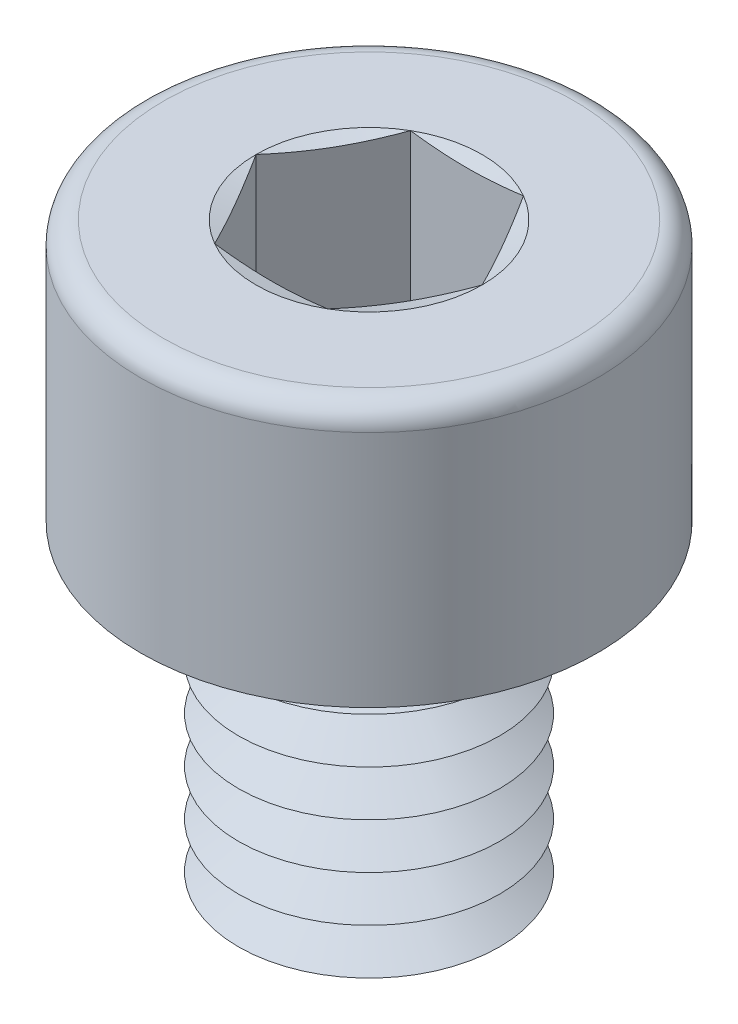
ISO-10303-21;
HEADER;
FILE_DESCRIPTION(('STEP AP214'),'2;1');
FILE_NAME('part.step','',(''),(''),'','','');
FILE_SCHEMA(('AUTOMOTIVE_DESIGN { 1 0 10303 214 1 1 1 1 }'));
ENDSEC;
DATA;
#1=APPLICATION_CONTEXT('core data for automotive mechanical design processes');
#2=APPLICATION_PROTOCOL_DEFINITION('international standard','automotive_design',2000,#1);
#3=PRODUCT_CONTEXT('',#1,'mechanical');
#4=PRODUCT('Part','Part','',(#3));
#5=PRODUCT_RELATED_PRODUCT_CATEGORY('part','',(#4));
#6=PRODUCT_DEFINITION_FORMATION('','',#4);
#7=PRODUCT_DEFINITION_CONTEXT('part definition',#1,'design');
#8=PRODUCT_DEFINITION('design','',#6,#7);
#9=PRODUCT_DEFINITION_SHAPE('','',#8);
#10=(LENGTH_UNIT() NAMED_UNIT(*) SI_UNIT(.MILLI.,.METRE.));
#11=(NAMED_UNIT(*) PLANE_ANGLE_UNIT() SI_UNIT($,.RADIAN.));
#12=(NAMED_UNIT(*) SI_UNIT($,.STERADIAN.) SOLID_ANGLE_UNIT());
#13=UNCERTAINTY_MEASURE_WITH_UNIT(LENGTH_MEASURE(1.E-05),#10,'distance_accuracy_value','');
#14=(GEOMETRIC_REPRESENTATION_CONTEXT(3) GLOBAL_UNCERTAINTY_ASSIGNED_CONTEXT((#13)) GLOBAL_UNIT_ASSIGNED_CONTEXT((#10,
#11,#12)) REPRESENTATION_CONTEXT('',''));
#15=CARTESIAN_POINT('',(0.,0.,0.));
#16=DIRECTION('',(0.,0.,1.));
#17=DIRECTION('',(1.,0.,0.));
#18=AXIS2_PLACEMENT_3D('',#15,#16,#17);
#19=CARTESIAN_POINT('',(0.,2.8,0.));
#20=DIRECTION('',(0.,1.,0.));
#21=DIRECTION('',(0.,0.,1.));
#22=AXIS2_PLACEMENT_3D('',#19,#20,#21);
#23=CONICAL_SURFACE('',#22,1.39378221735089,1.0471975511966);
#24=CARTESIAN_POINT('',(0.,3.15,0.));
#25=DIRECTION('',(0.,1.,0.));
#26=DIRECTION('',(0.,0.,1.));
#27=AXIS2_PLACEMENT_3D('',#24,#25,#26);
#28=CIRCLE('',#27,2.);
#29=CARTESIAN_POINT('',(0.,3.15,2.));
#30=VERTEX_POINT('',#29);
#31=EDGE_CURVE('E366',#30,#30,#28,.T.);
#32=ORIENTED_EDGE('',*,*,#31,.F.);
#33=EDGE_LOOP('',(#32));
#34=FACE_BOUND('',#33,.T.);
#35=CARTESIAN_POINT('',(0.,2.8,0.));
#36=DIRECTION('',(0.,1.,0.));
#37=DIRECTION('',(0.,0.,1.));
#38=AXIS2_PLACEMENT_3D('',#35,#36,#37);
#39=CIRCLE('',#38,1.39378221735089);
#40=CARTESIAN_POINT('',(0.,2.8,1.39378221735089));
#41=VERTEX_POINT('',#40);
#42=EDGE_CURVE('E370',#41,#41,#39,.T.);
#43=ORIENTED_EDGE('',*,*,#42,.T.);
#44=EDGE_LOOP('',(#43));
#45=FACE_BOUND('',#44,.T.);
#46=ADVANCED_FACE('F41',(#34,#45),#23,.T.);
#47=CARTESIAN_POINT('',(0.,2.45,0.));
#48=DIRECTION('',(0.,-1.,0.));
#49=DIRECTION('',(0.,0.,-1.));
#50=AXIS2_PLACEMENT_3D('',#47,#48,#49);
#51=CONICAL_SURFACE('',#50,2.,1.0471975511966);
#52=ORIENTED_EDGE('',*,*,#42,.F.);
#53=EDGE_LOOP('',(#52));
#54=FACE_BOUND('',#53,.T.);
#55=CARTESIAN_POINT('',(0.,2.45,0.));
#56=DIRECTION('',(0.,1.,0.));
#57=DIRECTION('',(0.,0.,1.));
#58=AXIS2_PLACEMENT_3D('',#55,#56,#57);
#59=CIRCLE('',#58,2.);
#60=CARTESIAN_POINT('',(0.,2.45,2.));
#61=VERTEX_POINT('',#60);
#62=EDGE_CURVE('E374',#61,#61,#59,.T.);
#63=ORIENTED_EDGE('',*,*,#62,.T.);
#64=EDGE_LOOP('',(#63));
#65=FACE_BOUND('',#64,.T.);
#66=ADVANCED_FACE('F250',(#54,#65),#51,.T.);
#67=CARTESIAN_POINT('',(0.,0.,0.));
#68=DIRECTION('',(0.,1.,0.));
#69=DIRECTION('',(0.,0.,1.));
#70=AXIS2_PLACEMENT_3D('',#67,#68,#69);
#71=PLANE('',#70);
#72=CARTESIAN_POINT('',(0.,0.,0.));
#73=DIRECTION('',(0.,1.,0.));
#74=DIRECTION('',(0.,0.,1.));
#75=AXIS2_PLACEMENT_3D('',#72,#73,#74);
#76=CIRCLE('',#75,1.39378221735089);
#77=CARTESIAN_POINT('',(0.,0.,1.39378221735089));
#78=VERTEX_POINT('',#77);
#79=EDGE_CURVE('E400',#78,#78,#76,.T.);
#80=ORIENTED_EDGE('',*,*,#79,.F.);
#81=EDGE_LOOP('',(#80));
#82=FACE_BOUND('',#81,.T.);
#83=ADVANCED_FACE('F247',(#82),#71,.F.);
#84=CARTESIAN_POINT('',(0.,0.,0.));
#85=DIRECTION('',(0.,1.,0.));
#86=DIRECTION('',(0.,0.,1.));
#87=AXIS2_PLACEMENT_3D('',#84,#85,#86);
#88=CONICAL_SURFACE('',#87,1.39378221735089,1.0471975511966);
#89=CARTESIAN_POINT('',(0.,0.35,0.));
#90=DIRECTION('',(0.,1.,0.));
#91=DIRECTION('',(0.,0.,1.));
#92=AXIS2_PLACEMENT_3D('',#89,#90,#91);
#93=CIRCLE('',#92,2.);
#94=CARTESIAN_POINT('',(0.,0.35,2.));
#95=VERTEX_POINT('',#94);
#96=EDGE_CURVE('E397',#95,#95,#93,.T.);
#97=ORIENTED_EDGE('',*,*,#96,.F.);
#98=EDGE_LOOP('',(#97));
#99=FACE_BOUND('',#98,.T.);
#100=ORIENTED_EDGE('',*,*,#79,.T.);
#101=EDGE_LOOP('',(#100));
#102=FACE_BOUND('',#101,.T.);
#103=ADVANCED_FACE('F249',(#99,#102),#88,.T.);
#104=CARTESIAN_POINT('',(0.,0.35,0.));
#105=DIRECTION('',(0.,-1.,0.));
#106=DIRECTION('',(0.,0.,-1.));
#107=AXIS2_PLACEMENT_3D('',#104,#105,#106);
#108=CONICAL_SURFACE('',#107,2.,1.0471975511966);
#109=CARTESIAN_POINT('',(0.,0.7,0.));
#110=DIRECTION('',(0.,1.,0.));
#111=DIRECTION('',(0.,0.,1.));
#112=AXIS2_PLACEMENT_3D('',#109,#110,#111);
#113=CIRCLE('',#112,1.39378221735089);
#114=CARTESIAN_POINT('',(0.,0.7,1.39378221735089));
#115=VERTEX_POINT('',#114);
#116=EDGE_CURVE('E393',#115,#115,#113,.T.);
#117=ORIENTED_EDGE('',*,*,#116,.F.);
#118=EDGE_LOOP('',(#117));
#119=FACE_BOUND('',#118,.T.);
#120=ORIENTED_EDGE('',*,*,#96,.T.);
#121=EDGE_LOOP('',(#120));
#122=FACE_BOUND('',#121,.T.);
#123=ADVANCED_FACE('F290',(#119,#122),#108,.T.);
#124=CARTESIAN_POINT('',(0.,0.7,0.));
#125=DIRECTION('',(0.,1.,0.));
#126=DIRECTION('',(0.,0.,1.));
#127=AXIS2_PLACEMENT_3D('',#124,#125,#126);
#128=CONICAL_SURFACE('',#127,1.39378221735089,1.0471975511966);
#129=CARTESIAN_POINT('',(0.,1.05,0.));
#130=DIRECTION('',(0.,1.,0.));
#131=DIRECTION('',(0.,0.,1.));
#132=AXIS2_PLACEMENT_3D('',#129,#130,#131);
#133=CIRCLE('',#132,2.);
#134=CARTESIAN_POINT('',(0.,1.05,2.));
#135=VERTEX_POINT('',#134);
#136=EDGE_CURVE('E389',#135,#135,#133,.T.);
#137=ORIENTED_EDGE('',*,*,#136,.F.);
#138=EDGE_LOOP('',(#137));
#139=FACE_BOUND('',#138,.T.);
#140=ORIENTED_EDGE('',*,*,#116,.T.);
#141=EDGE_LOOP('',(#140));
#142=FACE_BOUND('',#141,.T.);
#143=ADVANCED_FACE('F285',(#139,#142),#128,.T.);
#144=CARTESIAN_POINT('',(0.,1.05,0.));
#145=DIRECTION('',(0.,-1.,0.));
#146=DIRECTION('',(0.,0.,-1.));
#147=AXIS2_PLACEMENT_3D('',#144,#145,#146);
#148=CONICAL_SURFACE('',#147,2.,1.0471975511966);
#149=CARTESIAN_POINT('',(0.,1.4,0.));
#150=DIRECTION('',(0.,1.,0.));
#151=DIRECTION('',(0.,0.,1.));
#152=AXIS2_PLACEMENT_3D('',#149,#150,#151);
#153=CIRCLE('',#152,1.39378221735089);
#154=CARTESIAN_POINT('',(0.,1.4,1.39378221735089));
#155=VERTEX_POINT('',#154);
#156=EDGE_CURVE('E385',#155,#155,#153,.T.);
#157=ORIENTED_EDGE('',*,*,#156,.F.);
#158=EDGE_LOOP('',(#157));
#159=FACE_BOUND('',#158,.T.);
#160=ORIENTED_EDGE('',*,*,#136,.T.);
#161=EDGE_LOOP('',(#160));
#162=FACE_BOUND('',#161,.T.);
#163=ADVANCED_FACE('F282',(#159,#162),#148,.T.);
#164=CARTESIAN_POINT('',(0.,1.4,0.));
#165=DIRECTION('',(0.,1.,0.));
#166=DIRECTION('',(0.,0.,1.));
#167=AXIS2_PLACEMENT_3D('',#164,#165,#166);
#168=CONICAL_SURFACE('',#167,1.39378221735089,1.0471975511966);
#169=CARTESIAN_POINT('',(0.,1.75,0.));
#170=DIRECTION('',(0.,1.,0.));
#171=DIRECTION('',(0.,0.,1.));
#172=AXIS2_PLACEMENT_3D('',#169,#170,#171);
#173=CIRCLE('',#172,2.);
#174=CARTESIAN_POINT('',(0.,1.75,2.));
#175=VERTEX_POINT('',#174);
#176=EDGE_CURVE('E381',#175,#175,#173,.T.);
#177=ORIENTED_EDGE('',*,*,#176,.F.);
#178=EDGE_LOOP('',(#177));
#179=FACE_BOUND('',#178,.T.);
#180=ORIENTED_EDGE('',*,*,#156,.T.);
#181=EDGE_LOOP('',(#180));
#182=FACE_BOUND('',#181,.T.);
#183=ADVANCED_FACE('F276',(#179,#182),#168,.T.);
#184=CARTESIAN_POINT('',(0.,1.75,0.));
#185=DIRECTION('',(0.,-1.,0.));
#186=DIRECTION('',(0.,0.,-1.));
#187=AXIS2_PLACEMENT_3D('',#184,#185,#186);
#188=CONICAL_SURFACE('',#187,2.,1.0471975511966);
#189=CARTESIAN_POINT('',(0.,2.1,0.));
#190=DIRECTION('',(0.,1.,0.));
#191=DIRECTION('',(0.,0.,1.));
#192=AXIS2_PLACEMENT_3D('',#189,#190,#191);
#193=CIRCLE('',#192,1.39378221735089);
#194=CARTESIAN_POINT('',(0.,2.1,1.39378221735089));
#195=VERTEX_POINT('',#194);
#196=EDGE_CURVE('E377',#195,#195,#193,.T.);
#197=ORIENTED_EDGE('',*,*,#196,.F.);
#198=EDGE_LOOP('',(#197));
#199=FACE_BOUND('',#198,.T.);
#200=ORIENTED_EDGE('',*,*,#176,.T.);
#201=EDGE_LOOP('',(#200));
#202=FACE_BOUND('',#201,.T.);
#203=ADVANCED_FACE('F272',(#199,#202),#188,.T.);
#204=CARTESIAN_POINT('',(0.,2.1,0.));
#205=DIRECTION('',(0.,1.,0.));
#206=DIRECTION('',(0.,0.,1.));
#207=AXIS2_PLACEMENT_3D('',#204,#205,#206);
#208=CONICAL_SURFACE('',#207,1.39378221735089,1.0471975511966);
#209=ORIENTED_EDGE('',*,*,#62,.F.);
#210=EDGE_LOOP('',(#209));
#211=FACE_BOUND('',#210,.T.);
#212=ORIENTED_EDGE('',*,*,#196,.T.);
#213=EDGE_LOOP('',(#212));
#214=FACE_BOUND('',#213,.T.);
#215=ADVANCED_FACE('F275',(#211,#214),#208,.T.);
#216=CARTESIAN_POINT('',(0.,3.5,0.));
#217=DIRECTION('',(0.,1.,0.));
#218=DIRECTION('',(0.,0.,1.));
#219=AXIS2_PLACEMENT_3D('',#216,#217,#218);
#220=CONICAL_SURFACE('',#219,1.39378221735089,1.0471975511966);
#221=CARTESIAN_POINT('',(0.,3.85,0.));
#222=DIRECTION('',(0.,1.,0.));
#223=DIRECTION('',(0.,0.,1.));
#224=AXIS2_PLACEMENT_3D('',#221,#222,#223);
#225=CIRCLE('',#224,2.);
#226=CARTESIAN_POINT('',(0.,3.85,2.));
#227=VERTEX_POINT('',#226);
#228=EDGE_CURVE('E352',#227,#227,#225,.T.);
#229=ORIENTED_EDGE('',*,*,#228,.F.);
#230=EDGE_LOOP('',(#229));
#231=FACE_BOUND('',#230,.T.);
#232=CARTESIAN_POINT('',(0.,3.5,0.));
#233=DIRECTION('',(0.,1.,0.));
#234=DIRECTION('',(0.,0.,1.));
#235=AXIS2_PLACEMENT_3D('',#232,#233,#234);
#236=CIRCLE('',#235,1.39378221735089);
#237=CARTESIAN_POINT('',(0.,3.5,1.39378221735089));
#238=VERTEX_POINT('',#237);
#239=EDGE_CURVE('E362',#238,#238,#236,.T.);
#240=ORIENTED_EDGE('',*,*,#239,.T.);
#241=EDGE_LOOP('',(#240));
#242=FACE_BOUND('',#241,.T.);
#243=ADVANCED_FACE('F280',(#231,#242),#220,.T.);
#244=CARTESIAN_POINT('',(0.,3.15,0.));
#245=DIRECTION('',(0.,-1.,0.));
#246=DIRECTION('',(0.,0.,-1.));
#247=AXIS2_PLACEMENT_3D('',#244,#245,#246);
#248=CONICAL_SURFACE('',#247,2.,1.0471975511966);
#249=ORIENTED_EDGE('',*,*,#239,.F.);
#250=EDGE_LOOP('',(#249));
#251=FACE_BOUND('',#250,.T.);
#252=ORIENTED_EDGE('',*,*,#31,.T.);
#253=EDGE_LOOP('',(#252));
#254=FACE_BOUND('',#253,.T.);
#255=ADVANCED_FACE('F633',(#251,#254),#248,.T.);
#256=CARTESIAN_POINT('',(0.,4.2,0.));
#257=DIRECTION('',(0.,1.,0.));
#258=DIRECTION('',(0.,0.,1.));
#259=AXIS2_PLACEMENT_3D('',#256,#257,#258);
#260=CONICAL_SURFACE('',#259,1.39378221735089,1.0471975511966);
#261=CARTESIAN_POINT('',(0.,4.55,0.));
#262=DIRECTION('',(0.,1.,0.));
#263=DIRECTION('',(0.,0.,1.));
#264=AXIS2_PLACEMENT_3D('',#261,#262,#263);
#265=CIRCLE('',#264,2.);
#266=CARTESIAN_POINT('',(0.,4.55,2.));
#267=VERTEX_POINT('',#266);
#268=EDGE_CURVE('E358',#267,#267,#265,.T.);
#269=ORIENTED_EDGE('',*,*,#268,.F.);
#270=EDGE_LOOP('',(#269));
#271=FACE_BOUND('',#270,.T.);
#272=CARTESIAN_POINT('',(0.,4.2,0.));
#273=DIRECTION('',(0.,1.,0.));
#274=DIRECTION('',(0.,0.,1.));
#275=AXIS2_PLACEMENT_3D('',#272,#273,#274);
#276=CIRCLE('',#275,1.39378221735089);
#277=CARTESIAN_POINT('',(0.,4.2,1.39378221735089));
#278=VERTEX_POINT('',#277);
#279=EDGE_CURVE('E347',#278,#278,#276,.T.);
#280=ORIENTED_EDGE('',*,*,#279,.T.);
#281=EDGE_LOOP('',(#280));
#282=FACE_BOUND('',#281,.T.);
#283=ADVANCED_FACE('F642',(#271,#282),#260,.T.);
#284=CARTESIAN_POINT('',(0.,3.85,0.));
#285=DIRECTION('',(0.,-1.,0.));
#286=DIRECTION('',(0.,0.,-1.));
#287=AXIS2_PLACEMENT_3D('',#284,#285,#286);
#288=CONICAL_SURFACE('',#287,2.,1.0471975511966);
#289=ORIENTED_EDGE('',*,*,#279,.F.);
#290=EDGE_LOOP('',(#289));
#291=FACE_BOUND('',#290,.T.);
#292=ORIENTED_EDGE('',*,*,#228,.T.);
#293=EDGE_LOOP('',(#292));
#294=FACE_BOUND('',#293,.T.);
#295=ADVANCED_FACE('F194',(#291,#294),#288,.T.);
#296=CARTESIAN_POINT('',(0.,9.,0.));
#297=DIRECTION('',(0.,1.,0.));
#298=DIRECTION('',(0.,0.,1.));
#299=AXIS2_PLACEMENT_3D('',#296,#297,#298);
#300=PLANE('',#299);
#301=CARTESIAN_POINT('',(0.,9.,0.));
#302=DIRECTION('',(0.,1.,0.));
#303=DIRECTION('',(0.,0.,1.));
#304=AXIS2_PLACEMENT_3D('',#301,#302,#303);
#305=CIRCLE('',#304,1.73205080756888);
#306=CARTESIAN_POINT('',(0.86602540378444,9.,1.5));
#307=VERTEX_POINT('',#306);
#308=CARTESIAN_POINT('',(1.73205080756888,9.,0.));
#309=VERTEX_POINT('',#308);
#310=EDGE_CURVE('E121',#307,#309,#305,.T.);
#311=ORIENTED_EDGE('',*,*,#310,.F.);
#312=CARTESIAN_POINT('',(0.,9.,0.));
#313=DIRECTION('',(0.,1.,0.));
#314=DIRECTION('',(0.,0.,1.));
#315=AXIS2_PLACEMENT_3D('',#312,#313,#314);
#316=CIRCLE('',#315,1.73205080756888);
#317=CARTESIAN_POINT('',(-0.866025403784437,9.,1.5));
#318=VERTEX_POINT('',#317);
#319=EDGE_CURVE('E45',#318,#307,#316,.T.);
#320=ORIENTED_EDGE('',*,*,#319,.F.);
#321=CARTESIAN_POINT('',(-1.73205080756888,9.,0.));
#322=VERTEX_POINT('',#321);
#323=EDGE_CURVE('E138',#322,#318,#316,.T.);
#324=ORIENTED_EDGE('',*,*,#323,.F.);
#325=CARTESIAN_POINT('',(-0.866025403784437,9.,-1.5));
#326=VERTEX_POINT('',#325);
#327=EDGE_CURVE('E764',#326,#322,#316,.T.);
#328=ORIENTED_EDGE('',*,*,#327,.F.);
#329=CARTESIAN_POINT('',(0.866025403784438,9.,-1.5));
#330=VERTEX_POINT('',#329);
#331=EDGE_CURVE('E51',#330,#326,#316,.T.);
#332=ORIENTED_EDGE('',*,*,#331,.F.);
#333=EDGE_CURVE('E11',#309,#330,#316,.T.);
#334=ORIENTED_EDGE('',*,*,#333,.F.);
#335=EDGE_LOOP('',(#311,#320,#324,#328,#332,#334));
#336=FACE_BOUND('',#335,.T.);
#337=CARTESIAN_POINT('',(0.,9.,0.));
#338=DIRECTION('',(0.,1.,0.));
#339=DIRECTION('',(0.,0.,1.));
#340=AXIS2_PLACEMENT_3D('',#337,#338,#339);
#341=CIRCLE('',#340,3.15);
#342=CARTESIAN_POINT('',(0.,9.,3.15));
#343=VERTEX_POINT('',#342);
#344=EDGE_CURVE('E444',#343,#343,#341,.T.);
#345=ORIENTED_EDGE('',*,*,#344,.T.);
#346=EDGE_LOOP('',(#345));
#347=FACE_BOUND('',#346,.T.);
#348=ADVANCED_FACE('F140',(#336,#347),#300,.T.);
#349=CARTESIAN_POINT('',(0.,8.65,0.));
#350=DIRECTION('',(0.,1.,0.));
#351=DIRECTION('',(0.,0.,1.));
#352=AXIS2_PLACEMENT_3D('',#349,#350,#351);
#353=TOROIDAL_SURFACE('',#352,3.15,0.35);
#354=CARTESIAN_POINT('',(0.,8.65,0.));
#355=DIRECTION('',(0.,1.,0.));
#356=DIRECTION('',(0.,0.,1.));
#357=AXIS2_PLACEMENT_3D('',#354,#355,#356);
#358=CIRCLE('',#357,3.5);
#359=CARTESIAN_POINT('',(0.,8.65,3.5));
#360=VERTEX_POINT('',#359);
#361=EDGE_CURVE('E448',#360,#360,#358,.F.);
#362=ORIENTED_EDGE('',*,*,#361,.F.);
#363=EDGE_LOOP('',(#362));
#364=FACE_BOUND('',#363,.T.);
#365=ORIENTED_EDGE('',*,*,#344,.F.);
#366=EDGE_LOOP('',(#365));
#367=FACE_BOUND('',#366,.T.);
#368=ADVANCED_FACE('F43',(#364,#367),#353,.T.);
#369=CARTESIAN_POINT('',(0.,9.,0.));
#370=DIRECTION('',(0.,-1.,0.));
#371=DIRECTION('',(0.,0.,-1.));
#372=AXIS2_PLACEMENT_3D('',#369,#370,#371);
#373=CYLINDRICAL_SURFACE('',#372,3.5);
#374=ORIENTED_EDGE('',*,*,#361,.T.);
#375=EDGE_LOOP('',(#374));
#376=FACE_BOUND('',#375,.T.);
#377=CARTESIAN_POINT('',(0.,5.,0.));
#378=DIRECTION('',(0.,1.,0.));
#379=DIRECTION('',(0.,0.,1.));
#380=AXIS2_PLACEMENT_3D('',#377,#378,#379);
#381=CIRCLE('',#380,3.5);
#382=CARTESIAN_POINT('',(0.,5.,3.5));
#383=VERTEX_POINT('',#382);
#384=EDGE_CURVE('E431',#383,#383,#381,.T.);
#385=ORIENTED_EDGE('',*,*,#384,.T.);
#386=EDGE_LOOP('',(#385));
#387=FACE_BOUND('',#386,.T.);
#388=ADVANCED_FACE('F242',(#376,#387),#373,.T.);
#389=CARTESIAN_POINT('',(0.,5.,0.));
#390=DIRECTION('',(0.,1.,0.));
#391=DIRECTION('',(0.,0.,1.));
#392=AXIS2_PLACEMENT_3D('',#389,#390,#391);
#393=PLANE('',#392);
#394=ORIENTED_EDGE('',*,*,#384,.F.);
#395=EDGE_LOOP('',(#394));
#396=FACE_BOUND('',#395,.T.);
#397=CARTESIAN_POINT('',(0.,5.,0.));
#398=DIRECTION('',(0.,1.,0.));
#399=DIRECTION('',(0.,0.,1.));
#400=AXIS2_PLACEMENT_3D('',#397,#398,#399);
#401=CIRCLE('',#400,2.);
#402=CARTESIAN_POINT('',(0.,5.,2.));
#403=VERTEX_POINT('',#402);
#404=EDGE_CURVE('E440',#403,#403,#401,.T.);
#405=ORIENTED_EDGE('',*,*,#404,.T.);
#406=EDGE_LOOP('',(#405));
#407=FACE_BOUND('',#406,.T.);
#408=ADVANCED_FACE('F238',(#396,#407),#393,.F.);
#409=CARTESIAN_POINT('',(0.,5.,0.));
#410=DIRECTION('',(0.,-1.,0.));
#411=DIRECTION('',(0.,0.,-1.));
#412=AXIS2_PLACEMENT_3D('',#409,#410,#411);
#413=CYLINDRICAL_SURFACE('',#412,2.);
#414=ORIENTED_EDGE('',*,*,#268,.T.);
#415=EDGE_LOOP('',(#414));
#416=FACE_BOUND('',#415,.T.);
#417=ORIENTED_EDGE('',*,*,#404,.F.);
#418=EDGE_LOOP('',(#417));
#419=FACE_BOUND('',#418,.T.);
#420=ADVANCED_FACE('F241',(#416,#419),#413,.T.);
#421=CARTESIAN_POINT('',(0.,9.,0.));
#422=DIRECTION('',(0.,1.,0.));
#423=DIRECTION('',(0.,0.,1.));
#424=AXIS2_PLACEMENT_3D('',#421,#422,#423);
#425=CONICAL_SURFACE('',#424,1.73205080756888,1.30899693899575);
#426=ORIENTED_EDGE('',*,*,#319,.T.);
#427=CARTESIAN_POINT('',(-2.26080568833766,9.26288767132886,1.5));
#428=CARTESIAN_POINT('',(-2.19307335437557,9.24776718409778,1.5));
#429=CARTESIAN_POINT('',(-2.12529797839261,9.23283936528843,1.5));
#430=CARTESIAN_POINT('',(-1.989639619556,9.2034664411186,1.5));
#431=CARTESIAN_POINT('',(-1.92175663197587,9.1890213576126,1.5));
#432=CARTESIAN_POINT('',(-1.71778516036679,9.1465295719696,1.5));
#433=CARTESIAN_POINT('',(-1.58151166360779,9.11935744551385,1.5));
#434=CARTESIAN_POINT('',(-1.30947840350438,9.06878855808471,1.5));
#435=CARTESIAN_POINT('',(-1.17372447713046,9.04536102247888,1.5));
#436=CARTESIAN_POINT('',(-0.901404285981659,9.00385032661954,1.5));
#437=CARTESIAN_POINT('',(-0.764838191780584,8.98576608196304,1.5));
#438=CARTESIAN_POINT('',(-0.4892931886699,8.95729203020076,1.5));
#439=CARTESIAN_POINT('',(-0.350304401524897,8.94699084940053,1.5));
#440=CARTESIAN_POINT('',(-0.14157144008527,8.93918165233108,1.5));
#441=CARTESIAN_POINT('',(-0.0719628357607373,8.93785196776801,1.5));
#442=CARTESIAN_POINT('',(0.067255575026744,8.93779336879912,1.5));
#443=CARTESIAN_POINT('',(0.136865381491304,8.93906445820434,1.5));
#444=CARTESIAN_POINT('',(0.34611430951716,8.94672257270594,1.5));
#445=CARTESIAN_POINT('',(0.485619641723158,8.95697478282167,1.5));
#446=CARTESIAN_POINT('',(0.763829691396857,8.98560011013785,1.5));
#447=CARTESIAN_POINT('',(0.902533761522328,9.00397905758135,1.5));
#448=CARTESIAN_POINT('',(1.18270277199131,9.04677522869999,1.5));
#449=CARTESIAN_POINT('',(1.32414472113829,9.07133816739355,1.5));
#450=CARTESIAN_POINT('',(1.60634089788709,9.12417713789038,1.5));
#451=CARTESIAN_POINT('',(1.74709501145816,9.15245376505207,1.5));
#452=CARTESIAN_POINT('',(2.0281352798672,9.21141289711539,1.5));
#453=CARTESIAN_POINT('',(2.16842128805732,9.24209609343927,1.5));
#454=CARTESIAN_POINT('',(2.44863558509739,9.30505759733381,1.5));
#455=CARTESIAN_POINT('',(2.5885638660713,9.3373359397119,1.5));
#456=CARTESIAN_POINT('',(2.86645602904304,9.40258693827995,1.5));
#457=CARTESIAN_POINT('',(3.00442304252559,9.43554631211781,1.5));
#458=CARTESIAN_POINT('',(3.28017563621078,9.50222717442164,1.5));
#459=CARTESIAN_POINT('',(3.41796121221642,9.53594868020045,1.5));
#460=CARTESIAN_POINT('',(3.69320305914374,9.60389962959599,1.5));
#461=CARTESIAN_POINT('',(3.83065952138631,9.63812829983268,1.5));
#462=CARTESIAN_POINT('',(4.10546119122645,9.70700872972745,1.5));
#463=CARTESIAN_POINT('',(4.24280640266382,9.7416604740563,1.5));
#464=CARTESIAN_POINT('',(4.38011382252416,9.77645965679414,1.5));
#465=B_SPLINE_CURVE_WITH_KNOTS('',3,(#427,#428,#429,#430,#431,#432,#433,#434,#435,#436,#437,
#438,#439,#440,#441,#442,#443,#444,#445,#446,#447,#448,#449,#450,#451,#452,#453,#454,#455,#456,
#457,#458,#459,#460,#461,#462,#463,#464),.UNSPECIFIED.,.F.,.F.,(4,2,2,2,2,2,2,2,2,2,2,2,2,2,2,2,
2,2,4),(0.,0.208198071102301,0.416405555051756,0.833243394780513,1.2464565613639,
1.65958581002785,2.07735129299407,2.28617008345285,2.49498917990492,2.91428402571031,
3.33388016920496,3.76448033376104,4.19514961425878,4.62594308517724,5.05674596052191,
5.48229088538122,5.90784548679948,6.33280701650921,6.75775319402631),.UNSPECIFIED.);
#466=EDGE_CURVE('E127',#318,#307,#465,.T.);
#467=ORIENTED_EDGE('',*,*,#466,.F.);
#468=EDGE_LOOP('',(#426,#467));
#469=FACE_BOUND('',#468,.T.);
#470=ADVANCED_FACE('F132',(#469),#425,.F.);
#471=ORIENTED_EDGE('',*,*,#323,.T.);
#472=CARTESIAN_POINT('',(-1.73216627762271,9.00003094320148,-0.000200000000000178));
#473=CARTESIAN_POINT('',(-1.69619286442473,8.99038632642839,0.0621077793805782));
#474=CARTESIAN_POINT('',(-1.66015421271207,8.98163049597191,0.124528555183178));
#475=CARTESIAN_POINT('',(-1.58794959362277,8.96624719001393,0.249590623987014));
#476=CARTESIAN_POINT('',(-1.55178358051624,8.9596205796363,0.312231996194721));
#477=CARTESIAN_POINT('',(-1.47954358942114,8.94888268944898,0.437355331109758));
#478=CARTESIAN_POINT('',(-1.44347010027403,8.94475860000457,0.499836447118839));
#479=CARTESIAN_POINT('',(-1.37127710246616,8.93922860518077,0.624878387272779));
#480=CARTESIAN_POINT('',(-1.33515760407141,8.93782217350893,0.68743919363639));
#481=CARTESIAN_POINT('',(-1.26291860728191,8.93782217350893,0.81256080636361));
#482=CARTESIAN_POINT('',(-1.22679910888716,8.93922860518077,0.875121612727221));
#483=CARTESIAN_POINT('',(-1.15460611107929,8.94475860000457,1.00016355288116));
#484=CARTESIAN_POINT('',(-1.11853262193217,8.94888268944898,1.06264466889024));
#485=CARTESIAN_POINT('',(-1.04629263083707,8.9596205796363,1.18776800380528));
#486=CARTESIAN_POINT('',(-1.01012661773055,8.96624719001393,1.25040937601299));
#487=CARTESIAN_POINT('',(-0.93792199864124,8.98163049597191,1.37547144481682));
#488=CARTESIAN_POINT('',(-0.901883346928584,8.99038632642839,1.43789222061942));
#489=CARTESIAN_POINT('',(-0.8659099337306,9.00003094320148,1.5002));
#490=B_SPLINE_CURVE_WITH_KNOTS('',3,(#472,#473,#474,#475,#476,#477,#478,#479,#480,#481,#482,
#483,#484,#485,#486,#487,#488,#489),.UNSPECIFIED.,.F.,.F.,(4,2,2,2,2,2,2,2,4),(0.,
0.217782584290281,0.435653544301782,0.652399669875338,0.869103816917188,1.08580796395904,
1.30255408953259,1.52042504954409,1.73820763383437),.UNSPECIFIED.);
#491=EDGE_CURVE('E163',#322,#318,#490,.T.);
#492=ORIENTED_EDGE('',*,*,#491,.F.);
#493=EDGE_LOOP('',(#471,#492));
#494=FACE_BOUND('',#493,.T.);
#495=ADVANCED_FACE('F257',(#494),#425,.F.);
#496=ORIENTED_EDGE('',*,*,#327,.T.);
#497=CARTESIAN_POINT('',(-0.865909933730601,9.00003094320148,-1.5002));
#498=CARTESIAN_POINT('',(-0.901883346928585,8.99038632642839,-1.43789222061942));
#499=CARTESIAN_POINT('',(-0.937921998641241,8.98163049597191,-1.37547144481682));
#500=CARTESIAN_POINT('',(-1.01012661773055,8.96624719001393,-1.25040937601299));
#501=CARTESIAN_POINT('',(-1.04629263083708,8.9596205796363,-1.18776800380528));
#502=CARTESIAN_POINT('',(-1.11853262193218,8.94888268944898,-1.06264466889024));
#503=CARTESIAN_POINT('',(-1.15460611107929,8.94475860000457,-1.00016355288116));
#504=CARTESIAN_POINT('',(-1.22679910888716,8.93922860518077,-0.875121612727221));
#505=CARTESIAN_POINT('',(-1.26291860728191,8.93782217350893,-0.81256080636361));
#506=CARTESIAN_POINT('',(-1.33515760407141,8.93782217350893,-0.68743919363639));
#507=CARTESIAN_POINT('',(-1.37127710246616,8.93922860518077,-0.624878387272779));
#508=CARTESIAN_POINT('',(-1.44347010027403,8.94475860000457,-0.499836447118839));
#509=CARTESIAN_POINT('',(-1.47954358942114,8.94888268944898,-0.437355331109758));
#510=CARTESIAN_POINT('',(-1.55178358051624,8.9596205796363,-0.312231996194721));
#511=CARTESIAN_POINT('',(-1.58794959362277,8.96624719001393,-0.249590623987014));
#512=CARTESIAN_POINT('',(-1.66015421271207,8.98163049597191,-0.124528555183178));
#513=CARTESIAN_POINT('',(-1.69619286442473,8.99038632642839,-0.0621077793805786));
#514=CARTESIAN_POINT('',(-1.73216627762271,9.00003094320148,0.000199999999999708));
#515=B_SPLINE_CURVE_WITH_KNOTS('',3,(#497,#498,#499,#500,#501,#502,#503,#504,#505,#506,#507,
#508,#509,#510,#511,#512,#513,#514),.UNSPECIFIED.,.F.,.F.,(4,2,2,2,2,2,2,2,4),(0.,
0.217782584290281,0.435653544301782,0.652399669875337,0.869103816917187,1.08580796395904,
1.30255408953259,1.52042504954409,1.73820763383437),.UNSPECIFIED.);
#516=EDGE_CURVE('E63',#326,#322,#515,.T.);
#517=ORIENTED_EDGE('',*,*,#516,.F.);
#518=EDGE_LOOP('',(#496,#517));
#519=FACE_BOUND('',#518,.T.);
#520=ADVANCED_FACE('F192',(#519),#425,.F.);
#521=ORIENTED_EDGE('',*,*,#331,.T.);
#522=CARTESIAN_POINT('',(-2.26080568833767,9.26288767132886,-1.5));
#523=CARTESIAN_POINT('',(-2.19307335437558,9.24776718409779,-1.5));
#524=CARTESIAN_POINT('',(-2.12529797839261,9.23283936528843,-1.5));
#525=CARTESIAN_POINT('',(-1.989639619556,9.2034664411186,-1.5));
#526=CARTESIAN_POINT('',(-1.92175663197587,9.1890213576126,-1.5));
#527=CARTESIAN_POINT('',(-1.71778516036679,9.1465295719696,-1.5));
#528=CARTESIAN_POINT('',(-1.58151166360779,9.11935744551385,-1.5));
#529=CARTESIAN_POINT('',(-1.30947840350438,9.06878855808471,-1.5));
#530=CARTESIAN_POINT('',(-1.17372447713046,9.04536102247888,-1.5));
#531=CARTESIAN_POINT('',(-0.901404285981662,9.00385032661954,-1.5));
#532=CARTESIAN_POINT('',(-0.764838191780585,8.98576608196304,-1.5));
#533=CARTESIAN_POINT('',(-0.489293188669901,8.95729203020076,-1.5));
#534=CARTESIAN_POINT('',(-0.350304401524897,8.94699084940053,-1.5));
#535=CARTESIAN_POINT('',(-0.14157144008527,8.93918165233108,-1.5));
#536=CARTESIAN_POINT('',(-0.0719628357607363,8.93785196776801,-1.5));
#537=CARTESIAN_POINT('',(0.0672555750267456,8.93779336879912,-1.5));
#538=CARTESIAN_POINT('',(0.136865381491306,8.93906445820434,-1.5));
#539=CARTESIAN_POINT('',(0.346114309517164,8.94672257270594,-1.5));
#540=CARTESIAN_POINT('',(0.485619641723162,8.95697478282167,-1.5));
#541=CARTESIAN_POINT('',(0.763829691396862,8.98560011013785,-1.5));
#542=CARTESIAN_POINT('',(0.902533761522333,9.00397905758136,-1.5));
#543=CARTESIAN_POINT('',(1.18270277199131,9.04677522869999,-1.5));
#544=CARTESIAN_POINT('',(1.32414472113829,9.07133816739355,-1.5));
#545=CARTESIAN_POINT('',(1.60634089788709,9.12417713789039,-1.5));
#546=CARTESIAN_POINT('',(1.74709501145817,9.15245376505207,-1.5));
#547=CARTESIAN_POINT('',(2.02813527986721,9.21141289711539,-1.5));
#548=CARTESIAN_POINT('',(2.16842128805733,9.24209609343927,-1.5));
#549=CARTESIAN_POINT('',(2.4486355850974,9.30505759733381,-1.5));
#550=CARTESIAN_POINT('',(2.5885638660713,9.3373359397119,-1.5));
#551=CARTESIAN_POINT('',(2.86645602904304,9.40258693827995,-1.5));
#552=CARTESIAN_POINT('',(3.0044230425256,9.43554631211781,-1.5));
#553=CARTESIAN_POINT('',(3.28017563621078,9.50222717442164,-1.5));
#554=CARTESIAN_POINT('',(3.41796121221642,9.53594868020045,-1.5));
#555=CARTESIAN_POINT('',(3.69320305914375,9.60389962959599,-1.5));
#556=CARTESIAN_POINT('',(3.83065952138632,9.63812829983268,-1.5));
#557=CARTESIAN_POINT('',(4.10546119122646,9.70700872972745,-1.5));
#558=CARTESIAN_POINT('',(4.24280640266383,9.7416604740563,-1.5));
#559=CARTESIAN_POINT('',(4.38011382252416,9.77645965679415,-1.5));
#560=B_SPLINE_CURVE_WITH_KNOTS('',3,(#522,#523,#524,#525,#526,#527,#528,#529,#530,#531,#532,
#533,#534,#535,#536,#537,#538,#539,#540,#541,#542,#543,#544,#545,#546,#547,#548,#549,#550,#551,
#552,#553,#554,#555,#556,#557,#558,#559),.UNSPECIFIED.,.F.,.F.,(4,2,2,2,2,2,2,2,2,2,2,2,2,2,2,2,
2,2,4),(0.,0.208198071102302,0.416405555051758,0.833243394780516,1.2464565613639,
1.65958581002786,2.07735129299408,2.28617008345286,2.49498917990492,2.91428402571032,
3.33388016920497,3.76448033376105,4.19514961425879,4.62594308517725,5.05674596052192,
5.48229088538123,5.90784548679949,6.33280701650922,6.75775319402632),.UNSPECIFIED.);
#561=EDGE_CURVE('E213',#330,#326,#560,.F.);
#562=ORIENTED_EDGE('',*,*,#561,.F.);
#563=EDGE_LOOP('',(#521,#562));
#564=FACE_BOUND('',#563,.T.);
#565=ADVANCED_FACE('F187',(#564),#425,.F.);
#566=ORIENTED_EDGE('',*,*,#333,.T.);
#567=CARTESIAN_POINT('',(1.73216627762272,9.00003094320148,0.00020000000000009));
#568=CARTESIAN_POINT('',(1.69619286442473,8.99038632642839,-0.0621077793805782));
#569=CARTESIAN_POINT('',(1.66015421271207,8.98163049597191,-0.124528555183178));
#570=CARTESIAN_POINT('',(1.58794959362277,8.96624719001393,-0.249590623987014));
#571=CARTESIAN_POINT('',(1.55178358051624,8.9596205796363,-0.312231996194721));
#572=CARTESIAN_POINT('',(1.47954358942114,8.94888268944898,-0.437355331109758));
#573=CARTESIAN_POINT('',(1.44347010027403,8.94475860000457,-0.499836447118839));
#574=CARTESIAN_POINT('',(1.37127710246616,8.93922860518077,-0.624878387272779));
#575=CARTESIAN_POINT('',(1.33515760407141,8.93782217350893,-0.68743919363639));
#576=CARTESIAN_POINT('',(1.26291860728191,8.93782217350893,-0.81256080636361));
#577=CARTESIAN_POINT('',(1.22679910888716,8.93922860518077,-0.875121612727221));
#578=CARTESIAN_POINT('',(1.15460611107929,8.94475860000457,-1.00016355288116));
#579=CARTESIAN_POINT('',(1.11853262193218,8.94888268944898,-1.06264466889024));
#580=CARTESIAN_POINT('',(1.04629263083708,8.9596205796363,-1.18776800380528));
#581=CARTESIAN_POINT('',(1.01012661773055,8.96624719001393,-1.25040937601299));
#582=CARTESIAN_POINT('',(0.937921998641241,8.98163049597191,-1.37547144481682));
#583=CARTESIAN_POINT('',(0.901883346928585,8.99038632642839,-1.43789222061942));
#584=CARTESIAN_POINT('',(0.8659099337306,9.00003094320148,-1.5002));
#585=B_SPLINE_CURVE_WITH_KNOTS('',3,(#567,#568,#569,#570,#571,#572,#573,#574,#575,#576,#577,
#578,#579,#580,#581,#582,#583,#584),.UNSPECIFIED.,.F.,.F.,(4,2,2,2,2,2,2,2,4),(0.,
0.217782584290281,0.435653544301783,0.652399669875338,0.869103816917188,1.08580796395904,
1.30255408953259,1.52042504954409,1.73820763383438),.UNSPECIFIED.);
#586=EDGE_CURVE('E56',#309,#330,#585,.T.);
#587=ORIENTED_EDGE('',*,*,#586,.F.);
#588=EDGE_LOOP('',(#566,#587));
#589=FACE_BOUND('',#588,.T.);
#590=ADVANCED_FACE('F191',(#589),#425,.F.);
#591=ORIENTED_EDGE('',*,*,#310,.T.);
#592=CARTESIAN_POINT('',(0.865909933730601,9.00003094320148,1.5002));
#593=CARTESIAN_POINT('',(0.901883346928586,8.99038632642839,1.43789222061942));
#594=CARTESIAN_POINT('',(0.937921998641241,8.98163049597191,1.37547144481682));
#595=CARTESIAN_POINT('',(1.01012661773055,8.96624719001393,1.25040937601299));
#596=CARTESIAN_POINT('',(1.04629263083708,8.9596205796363,1.18776800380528));
#597=CARTESIAN_POINT('',(1.11853262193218,8.94888268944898,1.06264466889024));
#598=CARTESIAN_POINT('',(1.15460611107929,8.94475860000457,1.00016355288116));
#599=CARTESIAN_POINT('',(1.22679910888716,8.93922860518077,0.875121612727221));
#600=CARTESIAN_POINT('',(1.26291860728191,8.93782217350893,0.81256080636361));
#601=CARTESIAN_POINT('',(1.33515760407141,8.93782217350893,0.687439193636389));
#602=CARTESIAN_POINT('',(1.37127710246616,8.93922860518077,0.624878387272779));
#603=CARTESIAN_POINT('',(1.44347010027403,8.94475860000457,0.499836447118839));
#604=CARTESIAN_POINT('',(1.47954358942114,8.94888268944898,0.437355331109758));
#605=CARTESIAN_POINT('',(1.55178358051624,8.9596205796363,0.312231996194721));
#606=CARTESIAN_POINT('',(1.58794959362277,8.96624719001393,0.249590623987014));
#607=CARTESIAN_POINT('',(1.66015421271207,8.98163049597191,0.124528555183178));
#608=CARTESIAN_POINT('',(1.69619286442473,8.99038632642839,0.0621077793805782));
#609=CARTESIAN_POINT('',(1.73216627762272,9.00003094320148,-0.000200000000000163));
#610=B_SPLINE_CURVE_WITH_KNOTS('',3,(#592,#593,#594,#595,#596,#597,#598,#599,#600,#601,#602,
#603,#604,#605,#606,#607,#608,#609),.UNSPECIFIED.,.F.,.F.,(4,2,2,2,2,2,2,2,4),(0.,
0.217782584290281,0.435653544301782,0.652399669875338,0.869103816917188,1.08580796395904,
1.30255408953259,1.52042504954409,1.73820763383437),.UNSPECIFIED.);
#611=EDGE_CURVE('E117',#307,#309,#610,.T.);
#612=ORIENTED_EDGE('',*,*,#611,.F.);
#613=EDGE_LOOP('',(#591,#612));
#614=FACE_BOUND('',#613,.T.);
#615=ADVANCED_FACE('F119',(#614),#425,.F.);
#616=CARTESIAN_POINT('',(0.,6.00000000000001,0.));
#617=DIRECTION('',(0.,1.,0.));
#618=DIRECTION('',(0.,0.,1.));
#619=AXIS2_PLACEMENT_3D('',#616,#617,#618);
#620=CONICAL_SURFACE('',#619,1.5,1.0471975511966);
#621=CARTESIAN_POINT('',(0.,5.13397459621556,0.));
#622=VERTEX_POINT('',#621);
#623=VERTEX_LOOP('',#622);
#624=FACE_BOUND('',#623,.T.);
#625=CARTESIAN_POINT('',(0.,6.00000000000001,0.));
#626=DIRECTION('',(0.,1.,0.));
#627=DIRECTION('',(0.,0.,1.));
#628=AXIS2_PLACEMENT_3D('',#625,#626,#627);
#629=CIRCLE('',#628,1.5);
#630=CARTESIAN_POINT('',(0.,6.,1.5));
#631=VERTEX_POINT('',#630);
#632=CARTESIAN_POINT('',(1.29903810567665,6.,0.750000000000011));
#633=VERTEX_POINT('',#632);
#634=EDGE_CURVE('E404',#631,#633,#629,.T.);
#635=ORIENTED_EDGE('',*,*,#634,.T.);
#636=CARTESIAN_POINT('',(0.,6.,0.));
#637=DIRECTION('',(0.,1.,0.));
#638=DIRECTION('',(0.,0.,1.));
#639=AXIS2_PLACEMENT_3D('',#636,#637,#638);
#640=CIRCLE('',#639,1.49999999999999);
#641=CARTESIAN_POINT('',(1.29903810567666,6.00000000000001,-0.74999999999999));
#642=VERTEX_POINT('',#641);
#643=EDGE_CURVE('E139',#633,#642,#640,.T.);
#644=ORIENTED_EDGE('',*,*,#643,.T.);
#645=CARTESIAN_POINT('',(0.,6.00000000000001,-1.5));
#646=VERTEX_POINT('',#645);
#647=EDGE_CURVE('E460',#642,#646,#640,.T.);
#648=ORIENTED_EDGE('',*,*,#647,.T.);
#649=CARTESIAN_POINT('',(-1.29903810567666,6.00000000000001,-0.74999999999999));
#650=VERTEX_POINT('',#649);
#651=EDGE_CURVE('E459',#646,#650,#640,.T.);
#652=ORIENTED_EDGE('',*,*,#651,.T.);
#653=CARTESIAN_POINT('',(-1.29903810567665,6.,0.75000000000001));
#654=VERTEX_POINT('',#653);
#655=EDGE_CURVE('E453',#650,#654,#640,.T.);
#656=ORIENTED_EDGE('',*,*,#655,.T.);
#657=EDGE_CURVE('E451',#654,#631,#640,.T.);
#658=ORIENTED_EDGE('',*,*,#657,.T.);
#659=EDGE_LOOP('',(#635,#644,#648,#652,#656,#658));
#660=FACE_BOUND('',#659,.T.);
#661=ADVANCED_FACE('F300',(#624,#660),#620,.F.);
#662=CARTESIAN_POINT('',(0.866025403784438,6.,-1.5));
#663=DIRECTION('',(0.,1.,0.));
#664=DIRECTION('',(0.,0.,1.));
#665=AXIS2_PLACEMENT_3D('',#662,#663,#664);
#666=PLANE('',#665);
#667=ORIENTED_EDGE('',*,*,#651,.F.);
#668=DIRECTION('',(-1.,0.,0.));
#669=VECTOR('',#668,1.);
#670=CARTESIAN_POINT('',(0.866025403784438,6.,-1.5));
#671=LINE('',#670,#669);
#672=CARTESIAN_POINT('',(-0.866025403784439,6.,-1.5));
#673=VERTEX_POINT('',#672);
#674=EDGE_CURVE('E412',#646,#673,#671,.T.);
#675=ORIENTED_EDGE('',*,*,#674,.T.);
#676=DIRECTION('',(-0.5,0.,0.866025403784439));
#677=VECTOR('',#676,1.);
#678=CARTESIAN_POINT('',(-0.866025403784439,6.,-1.5));
#679=LINE('',#678,#677);
#680=EDGE_CURVE('E337',#673,#650,#679,.T.);
#681=ORIENTED_EDGE('',*,*,#680,.T.);
#682=EDGE_LOOP('',(#667,#675,#681));
#683=FACE_BOUND('',#682,.T.);
#684=ADVANCED_FACE('F303',(#683),#666,.T.);
#685=ORIENTED_EDGE('',*,*,#655,.F.);
#686=CARTESIAN_POINT('',(-1.73205080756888,6.,0.));
#687=VERTEX_POINT('',#686);
#688=EDGE_CURVE('E417',#650,#687,#679,.T.);
#689=ORIENTED_EDGE('',*,*,#688,.T.);
#690=DIRECTION('',(0.5,0.,0.866025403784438));
#691=VECTOR('',#690,1.);
#692=CARTESIAN_POINT('',(-1.73205080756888,6.,0.));
#693=LINE('',#692,#691);
#694=EDGE_CURVE('E327',#687,#654,#693,.T.);
#695=ORIENTED_EDGE('',*,*,#694,.T.);
#696=EDGE_LOOP('',(#685,#689,#695));
#697=FACE_BOUND('',#696,.T.);
#698=ADVANCED_FACE('F308',(#697),#666,.T.);
#699=ORIENTED_EDGE('',*,*,#657,.F.);
#700=CARTESIAN_POINT('',(-0.866025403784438,6.,1.5));
#701=VERTEX_POINT('',#700);
#702=EDGE_CURVE('E419',#654,#701,#693,.T.);
#703=ORIENTED_EDGE('',*,*,#702,.T.);
#704=DIRECTION('',(1.,0.,0.));
#705=VECTOR('',#704,1.);
#706=CARTESIAN_POINT('',(-0.866025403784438,6.,1.5));
#707=LINE('',#706,#705);
#708=EDGE_CURVE('E423',#701,#631,#707,.T.);
#709=ORIENTED_EDGE('',*,*,#708,.T.);
#710=EDGE_LOOP('',(#699,#703,#709));
#711=FACE_BOUND('',#710,.T.);
#712=ADVANCED_FACE('F305',(#711),#666,.T.);
#713=ORIENTED_EDGE('',*,*,#634,.F.);
#714=CARTESIAN_POINT('',(0.866025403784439,6.,1.5));
#715=VERTEX_POINT('',#714);
#716=EDGE_CURVE('E422',#631,#715,#707,.T.);
#717=ORIENTED_EDGE('',*,*,#716,.T.);
#718=DIRECTION('',(0.5,0.,-0.866025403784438));
#719=VECTOR('',#718,1.);
#720=CARTESIAN_POINT('',(0.866025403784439,6.,1.5));
#721=LINE('',#720,#719);
#722=EDGE_CURVE('E151',#715,#633,#721,.T.);
#723=ORIENTED_EDGE('',*,*,#722,.T.);
#724=EDGE_LOOP('',(#713,#717,#723));
#725=FACE_BOUND('',#724,.T.);
#726=ADVANCED_FACE('F307',(#725),#666,.T.);
#727=ORIENTED_EDGE('',*,*,#643,.F.);
#728=CARTESIAN_POINT('',(1.73205080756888,6.,0.));
#729=VERTEX_POINT('',#728);
#730=EDGE_CURVE('E427',#633,#729,#721,.T.);
#731=ORIENTED_EDGE('',*,*,#730,.T.);
#732=DIRECTION('',(-0.5,0.,-0.866025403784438));
#733=VECTOR('',#732,1.);
#734=CARTESIAN_POINT('',(1.73205080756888,6.,0.));
#735=LINE('',#734,#733);
#736=EDGE_CURVE('E408',#729,#642,#735,.T.);
#737=ORIENTED_EDGE('',*,*,#736,.T.);
#738=EDGE_LOOP('',(#727,#731,#737));
#739=FACE_BOUND('',#738,.T.);
#740=ADVANCED_FACE('F478',(#739),#666,.T.);
#741=ORIENTED_EDGE('',*,*,#647,.F.);
#742=CARTESIAN_POINT('',(0.866025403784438,6.,-1.5));
#743=VERTEX_POINT('',#742);
#744=EDGE_CURVE('E407',#642,#743,#735,.T.);
#745=ORIENTED_EDGE('',*,*,#744,.T.);
#746=EDGE_CURVE('E413',#743,#646,#671,.T.);
#747=ORIENTED_EDGE('',*,*,#746,.T.);
#748=EDGE_LOOP('',(#741,#745,#747));
#749=FACE_BOUND('',#748,.T.);
#750=ADVANCED_FACE('F234',(#749),#666,.T.);
#751=CARTESIAN_POINT('',(1.73205080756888,6.,0.));
#752=DIRECTION('',(0.866025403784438,0.,-0.5));
#753=DIRECTION('',(-0.5,0.,-0.866025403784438));
#754=AXIS2_PLACEMENT_3D('',#751,#752,#753);
#755=PLANE('',#754);
#756=DIRECTION('',(0.,1.,0.));
#757=VECTOR('',#756,1.);
#758=CARTESIAN_POINT('',(1.73205080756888,6.,0.));
#759=LINE('',#758,#757);
#760=EDGE_CURVE('E155',#729,#309,#759,.T.);
#761=ORIENTED_EDGE('',*,*,#760,.T.);
#762=ORIENTED_EDGE('',*,*,#586,.T.);
#763=DIRECTION('',(0.,1.,0.));
#764=VECTOR('',#763,1.);
#765=CARTESIAN_POINT('',(0.866025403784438,6.,-1.5));
#766=LINE('',#765,#764);
#767=EDGE_CURVE('E340',#743,#330,#766,.T.);
#768=ORIENTED_EDGE('',*,*,#767,.F.);
#769=ORIENTED_EDGE('',*,*,#744,.F.);
#770=ORIENTED_EDGE('',*,*,#736,.F.);
#771=EDGE_LOOP('',(#761,#762,#768,#769,#770));
#772=FACE_BOUND('',#771,.T.);
#773=ADVANCED_FACE('F230',(#772),#755,.F.);
#774=CARTESIAN_POINT('',(0.866025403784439,6.,1.5));
#775=DIRECTION('',(0.866025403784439,0.,0.5));
#776=DIRECTION('',(0.5,0.,-0.866025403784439));
#777=AXIS2_PLACEMENT_3D('',#774,#775,#776);
#778=PLANE('',#777);
#779=DIRECTION('',(0.,1.,0.));
#780=VECTOR('',#779,1.);
#781=CARTESIAN_POINT('',(0.866025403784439,6.,1.5));
#782=LINE('',#781,#780);
#783=EDGE_CURVE('E147',#715,#307,#782,.T.);
#784=ORIENTED_EDGE('',*,*,#783,.T.);
#785=ORIENTED_EDGE('',*,*,#611,.T.);
#786=ORIENTED_EDGE('',*,*,#760,.F.);
#787=ORIENTED_EDGE('',*,*,#730,.F.);
#788=ORIENTED_EDGE('',*,*,#722,.F.);
#789=EDGE_LOOP('',(#784,#785,#786,#787,#788));
#790=FACE_BOUND('',#789,.T.);
#791=ADVANCED_FACE('F148',(#790),#778,.F.);
#792=CARTESIAN_POINT('',(-0.866025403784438,6.,1.5));
#793=DIRECTION('',(0.,0.,1.));
#794=DIRECTION('',(1.,0.,0.));
#795=AXIS2_PLACEMENT_3D('',#792,#793,#794);
#796=PLANE('',#795);
#797=DIRECTION('',(0.,1.,0.));
#798=VECTOR('',#797,1.);
#799=CARTESIAN_POINT('',(-0.866025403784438,6.,1.5));
#800=LINE('',#799,#798);
#801=EDGE_CURVE('E156',#701,#318,#800,.T.);
#802=ORIENTED_EDGE('',*,*,#801,.T.);
#803=ORIENTED_EDGE('',*,*,#466,.T.);
#804=ORIENTED_EDGE('',*,*,#783,.F.);
#805=ORIENTED_EDGE('',*,*,#716,.F.);
#806=ORIENTED_EDGE('',*,*,#708,.F.);
#807=EDGE_LOOP('',(#802,#803,#804,#805,#806));
#808=FACE_BOUND('',#807,.T.);
#809=ADVANCED_FACE('F158',(#808),#796,.F.);
#810=CARTESIAN_POINT('',(-1.73205080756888,6.,0.));
#811=DIRECTION('',(-0.866025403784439,0.,0.5));
#812=DIRECTION('',(0.5,0.,0.866025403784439));
#813=AXIS2_PLACEMENT_3D('',#810,#811,#812);
#814=PLANE('',#813);
#815=DIRECTION('',(0.,1.,0.));
#816=VECTOR('',#815,1.);
#817=CARTESIAN_POINT('',(-1.73205080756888,6.,0.));
#818=LINE('',#817,#816);
#819=EDGE_CURVE('E324',#687,#322,#818,.T.);
#820=ORIENTED_EDGE('',*,*,#819,.T.);
#821=ORIENTED_EDGE('',*,*,#491,.T.);
#822=ORIENTED_EDGE('',*,*,#801,.F.);
#823=ORIENTED_EDGE('',*,*,#702,.F.);
#824=ORIENTED_EDGE('',*,*,#694,.F.);
#825=EDGE_LOOP('',(#820,#821,#822,#823,#824));
#826=FACE_BOUND('',#825,.T.);
#827=ADVANCED_FACE('F224',(#826),#814,.F.);
#828=CARTESIAN_POINT('',(-0.866025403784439,6.,-1.5));
#829=DIRECTION('',(-0.866025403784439,0.,-0.5));
#830=DIRECTION('',(-0.5,0.,0.866025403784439));
#831=AXIS2_PLACEMENT_3D('',#828,#829,#830);
#832=PLANE('',#831);
#833=DIRECTION('',(0.,1.,0.));
#834=VECTOR('',#833,1.);
#835=CARTESIAN_POINT('',(-0.866025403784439,6.,-1.5));
#836=LINE('',#835,#834);
#837=EDGE_CURVE('E330',#673,#326,#836,.T.);
#838=ORIENTED_EDGE('',*,*,#837,.T.);
#839=ORIENTED_EDGE('',*,*,#516,.T.);
#840=ORIENTED_EDGE('',*,*,#819,.F.);
#841=ORIENTED_EDGE('',*,*,#688,.F.);
#842=ORIENTED_EDGE('',*,*,#680,.F.);
#843=EDGE_LOOP('',(#838,#839,#840,#841,#842));
#844=FACE_BOUND('',#843,.T.);
#845=ADVANCED_FACE('F220',(#844),#832,.F.);
#846=CARTESIAN_POINT('',(0.866025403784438,6.,-1.5));
#847=DIRECTION('',(0.,0.,-1.));
#848=DIRECTION('',(-1.,0.,0.));
#849=AXIS2_PLACEMENT_3D('',#846,#847,#848);
#850=PLANE('',#849);
#851=ORIENTED_EDGE('',*,*,#767,.T.);
#852=ORIENTED_EDGE('',*,*,#561,.T.);
#853=ORIENTED_EDGE('',*,*,#837,.F.);
#854=ORIENTED_EDGE('',*,*,#674,.F.);
#855=ORIENTED_EDGE('',*,*,#746,.F.);
#856=EDGE_LOOP('',(#851,#852,#853,#854,#855));
#857=FACE_BOUND('',#856,.T.);
#858=ADVANCED_FACE('F223',(#857),#850,.F.);
#859=CLOSED_SHELL('',(#46,#66,#83,#103,#123,#143,#163,#183,#203,#215,#243,#255,#283,#295,#348,
#368,#388,#408,#420,#470,#495,#520,#565,#590,#615,#661,#684,#698,#712,#726,#740,#750,#773,#791,
#809,#827,#845,#858));
#860=MANIFOLD_SOLID_BREP('B2',#859);
#861=ADVANCED_BREP_SHAPE_REPRESENTATION('',(#18,#860),#14);
#862=SHAPE_DEFINITION_REPRESENTATION(#9,#861);
ENDSEC;
END-ISO-10303-21;
